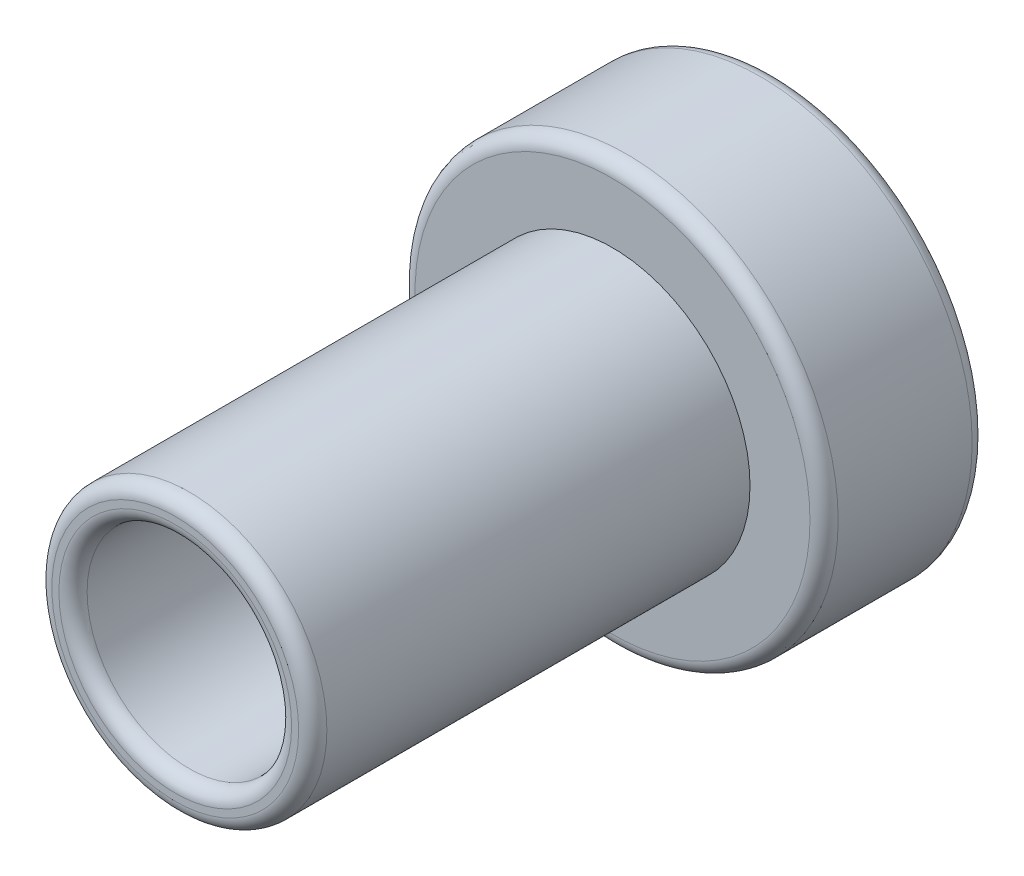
ISO-10303-21;
HEADER;
FILE_DESCRIPTION(('STEP AP214'),'2;1');
FILE_NAME('part.step','',(''),(''),'','','');
FILE_SCHEMA(('AUTOMOTIVE_DESIGN { 1 0 10303 214 1 1 1 1 }'));
ENDSEC;
DATA;
#1=APPLICATION_CONTEXT('core data for automotive mechanical design processes');
#2=APPLICATION_PROTOCOL_DEFINITION('international standard','automotive_design',2000,#1);
#3=PRODUCT_CONTEXT('',#1,'mechanical');
#4=PRODUCT('Part','Part','',(#3));
#5=PRODUCT_RELATED_PRODUCT_CATEGORY('part','',(#4));
#6=PRODUCT_DEFINITION_FORMATION('','',#4);
#7=PRODUCT_DEFINITION_CONTEXT('part definition',#1,'design');
#8=PRODUCT_DEFINITION('design','',#6,#7);
#9=PRODUCT_DEFINITION_SHAPE('','',#8);
#10=(LENGTH_UNIT() NAMED_UNIT(*) SI_UNIT(.MILLI.,.METRE.));
#11=(NAMED_UNIT(*) PLANE_ANGLE_UNIT() SI_UNIT($,.RADIAN.));
#12=(NAMED_UNIT(*) SI_UNIT($,.STERADIAN.) SOLID_ANGLE_UNIT());
#13=UNCERTAINTY_MEASURE_WITH_UNIT(LENGTH_MEASURE(1.E-05),#10,'distance_accuracy_value','');
#14=(GEOMETRIC_REPRESENTATION_CONTEXT(3) GLOBAL_UNCERTAINTY_ASSIGNED_CONTEXT((#13)) GLOBAL_UNIT_ASSIGNED_CONTEXT((#10,
#11,#12)) REPRESENTATION_CONTEXT('',''));
#15=CARTESIAN_POINT('',(0.,0.,0.));
#16=DIRECTION('',(0.,0.,1.));
#17=DIRECTION('',(1.,0.,0.));
#18=AXIS2_PLACEMENT_3D('',#15,#16,#17);
#19=CARTESIAN_POINT('',(0.,0.,2.3));
#20=DIRECTION('',(0.,0.,1.));
#21=DIRECTION('',(1.,0.,0.));
#22=AXIS2_PLACEMENT_3D('',#19,#20,#21);
#23=PLANE('',#22);
#24=CARTESIAN_POINT('',(0.,0.,2.3));
#25=DIRECTION('',(0.,0.,1.));
#26=DIRECTION('',(1.,0.,0.));
#27=AXIS2_PLACEMENT_3D('',#24,#25,#26);
#28=CIRCLE('',#27,2.8);
#29=CARTESIAN_POINT('',(2.8,0.,2.3));
#30=VERTEX_POINT('',#29);
#31=EDGE_CURVE('E31',#30,#30,#28,.T.);
#32=ORIENTED_EDGE('',*,*,#31,.T.);
#33=EDGE_LOOP('',(#32));
#34=FACE_BOUND('',#33,.T.);
#35=CARTESIAN_POINT('',(0.,0.,2.3));
#36=DIRECTION('',(0.,0.,1.));
#37=DIRECTION('',(1.,0.,0.));
#38=AXIS2_PLACEMENT_3D('',#35,#36,#37);
#39=CIRCLE('',#38,1.95);
#40=CARTESIAN_POINT('',(-1.95,0.,2.3));
#41=VERTEX_POINT('',#40);
#42=EDGE_CURVE('E62',#41,#41,#39,.T.);
#43=ORIENTED_EDGE('',*,*,#42,.F.);
#44=EDGE_LOOP('',(#43));
#45=FACE_BOUND('',#44,.T.);
#46=ADVANCED_FACE('F24',(#34,#45),#23,.T.);
#47=CARTESIAN_POINT('',(0.,0.,2.3));
#48=DIRECTION('',(0.,0.,-1.));
#49=DIRECTION('',(-1.,0.,0.));
#50=AXIS2_PLACEMENT_3D('',#47,#48,#49);
#51=CYLINDRICAL_SURFACE('',#50,3.);
#52=CARTESIAN_POINT('',(0.,0.,0.2));
#53=DIRECTION('',(0.,0.,1.));
#54=DIRECTION('',(1.,0.,0.));
#55=AXIS2_PLACEMENT_3D('',#52,#53,#54);
#56=CIRCLE('',#55,3.);
#57=CARTESIAN_POINT('',(3.,0.,0.2));
#58=VERTEX_POINT('',#57);
#59=EDGE_CURVE('E35',#58,#58,#56,.T.);
#60=ORIENTED_EDGE('',*,*,#59,.T.);
#61=EDGE_LOOP('',(#60));
#62=FACE_BOUND('',#61,.T.);
#63=CARTESIAN_POINT('',(0.,0.,2.1));
#64=DIRECTION('',(0.,0.,1.));
#65=DIRECTION('',(1.,0.,0.));
#66=AXIS2_PLACEMENT_3D('',#63,#64,#65);
#67=CIRCLE('',#66,3.);
#68=CARTESIAN_POINT('',(3.,0.,2.1));
#69=VERTEX_POINT('',#68);
#70=EDGE_CURVE('E39',#69,#69,#67,.F.);
#71=ORIENTED_EDGE('',*,*,#70,.T.);
#72=EDGE_LOOP('',(#71));
#73=FACE_BOUND('',#72,.T.);
#74=ADVANCED_FACE('F26',(#62,#73),#51,.T.);
#75=CARTESIAN_POINT('',(0.,0.,0.));
#76=DIRECTION('',(0.,0.,1.));
#77=DIRECTION('',(1.,0.,0.));
#78=AXIS2_PLACEMENT_3D('',#75,#76,#77);
#79=PLANE('',#78);
#80=CARTESIAN_POINT('',(0.,0.,0.));
#81=DIRECTION('',(0.,0.,1.));
#82=DIRECTION('',(1.,0.,0.));
#83=AXIS2_PLACEMENT_3D('',#80,#81,#82);
#84=CIRCLE('',#83,1.65);
#85=CARTESIAN_POINT('',(1.65,0.,0.));
#86=VERTEX_POINT('',#85);
#87=EDGE_CURVE('E56',#86,#86,#84,.T.);
#88=ORIENTED_EDGE('',*,*,#87,.T.);
#89=EDGE_LOOP('',(#88));
#90=FACE_BOUND('',#89,.T.);
#91=CARTESIAN_POINT('',(0.,0.,0.));
#92=DIRECTION('',(0.,0.,1.));
#93=DIRECTION('',(1.,0.,0.));
#94=AXIS2_PLACEMENT_3D('',#91,#92,#93);
#95=CIRCLE('',#94,2.8);
#96=CARTESIAN_POINT('',(2.8,0.,0.));
#97=VERTEX_POINT('',#96);
#98=EDGE_CURVE('E59',#97,#97,#95,.F.);
#99=ORIENTED_EDGE('',*,*,#98,.T.);
#100=EDGE_LOOP('',(#99));
#101=FACE_BOUND('',#100,.T.);
#102=ADVANCED_FACE('F72',(#90,#101),#79,.F.);
#103=CARTESIAN_POINT('',(0.,0.,8.5));
#104=DIRECTION('',(0.,0.,-1.));
#105=DIRECTION('',(-1.,0.,0.));
#106=AXIS2_PLACEMENT_3D('',#103,#104,#105);
#107=CYLINDRICAL_SURFACE('',#106,1.95);
#108=CARTESIAN_POINT('',(0.,0.,8.3));
#109=DIRECTION('',(0.,0.,1.));
#110=DIRECTION('',(1.,0.,0.));
#111=AXIS2_PLACEMENT_3D('',#108,#109,#110);
#112=CIRCLE('',#111,1.95);
#113=CARTESIAN_POINT('',(-1.95,0.,8.3));
#114=VERTEX_POINT('',#113);
#115=EDGE_CURVE('E10',#114,#114,#112,.F.);
#116=CARTESIAN_POINT('',(-1.95,0.,8.3));
#117=CARTESIAN_POINT('',(-1.95,0.,8.2375));
#118=CARTESIAN_POINT('',(-1.95,0.,8.175));
#119=CARTESIAN_POINT('',(-1.95,0.,8.05));
#120=CARTESIAN_POINT('',(-1.95,0.,7.9875));
#121=CARTESIAN_POINT('',(-1.95,0.,7.8625));
#122=CARTESIAN_POINT('',(-1.95,0.,7.8));
#123=CARTESIAN_POINT('',(-1.95,0.,7.675));
#124=CARTESIAN_POINT('',(-1.95,0.,7.6125));
#125=CARTESIAN_POINT('',(-1.95,0.,7.4875));
#126=CARTESIAN_POINT('',(-1.95,0.,7.425));
#127=CARTESIAN_POINT('',(-1.95,0.,7.3));
#128=CARTESIAN_POINT('',(-1.95,0.,7.2375));
#129=CARTESIAN_POINT('',(-1.95,0.,7.1125));
#130=CARTESIAN_POINT('',(-1.95,0.,7.05));
#131=CARTESIAN_POINT('',(-1.95,0.,6.925));
#132=CARTESIAN_POINT('',(-1.95,0.,6.8625));
#133=CARTESIAN_POINT('',(-1.95,0.,6.7375));
#134=CARTESIAN_POINT('',(-1.95,0.,6.675));
#135=CARTESIAN_POINT('',(-1.95,0.,6.55));
#136=CARTESIAN_POINT('',(-1.95,0.,6.4875));
#137=CARTESIAN_POINT('',(-1.95,0.,6.3625));
#138=CARTESIAN_POINT('',(-1.95,0.,6.3));
#139=CARTESIAN_POINT('',(-1.95,0.,6.175));
#140=CARTESIAN_POINT('',(-1.95,0.,6.1125));
#141=CARTESIAN_POINT('',(-1.95,0.,5.9875));
#142=CARTESIAN_POINT('',(-1.95,0.,5.925));
#143=CARTESIAN_POINT('',(-1.95,0.,5.8));
#144=CARTESIAN_POINT('',(-1.95,0.,5.7375));
#145=CARTESIAN_POINT('',(-1.95,0.,5.6125));
#146=CARTESIAN_POINT('',(-1.95,0.,5.55));
#147=CARTESIAN_POINT('',(-1.95,0.,5.425));
#148=CARTESIAN_POINT('',(-1.95,0.,5.3625));
#149=CARTESIAN_POINT('',(-1.95,0.,5.2375));
#150=CARTESIAN_POINT('',(-1.95,0.,5.175));
#151=CARTESIAN_POINT('',(-1.95,0.,5.05));
#152=CARTESIAN_POINT('',(-1.95,0.,4.9875));
#153=CARTESIAN_POINT('',(-1.95,0.,4.8625));
#154=CARTESIAN_POINT('',(-1.95,0.,4.8));
#155=CARTESIAN_POINT('',(-1.95,0.,4.675));
#156=CARTESIAN_POINT('',(-1.95,0.,4.6125));
#157=CARTESIAN_POINT('',(-1.95,0.,4.4875));
#158=CARTESIAN_POINT('',(-1.95,0.,4.425));
#159=CARTESIAN_POINT('',(-1.95,0.,4.3));
#160=CARTESIAN_POINT('',(-1.95,0.,4.2375));
#161=CARTESIAN_POINT('',(-1.95,0.,4.1125));
#162=CARTESIAN_POINT('',(-1.95,0.,4.05));
#163=CARTESIAN_POINT('',(-1.95,0.,3.925));
#164=CARTESIAN_POINT('',(-1.95,0.,3.8625));
#165=CARTESIAN_POINT('',(-1.95,0.,3.7375));
#166=CARTESIAN_POINT('',(-1.95,0.,3.675));
#167=CARTESIAN_POINT('',(-1.95,0.,3.55));
#168=CARTESIAN_POINT('',(-1.95,0.,3.4875));
#169=CARTESIAN_POINT('',(-1.95,0.,3.3625));
#170=CARTESIAN_POINT('',(-1.95,0.,3.3));
#171=CARTESIAN_POINT('',(-1.95,0.,3.175));
#172=CARTESIAN_POINT('',(-1.95,0.,3.1125));
#173=CARTESIAN_POINT('',(-1.95,0.,2.9875));
#174=CARTESIAN_POINT('',(-1.95,0.,2.925));
#175=CARTESIAN_POINT('',(-1.95,0.,2.8));
#176=CARTESIAN_POINT('',(-1.95,0.,2.7375));
#177=CARTESIAN_POINT('',(-1.95,0.,2.6125));
#178=CARTESIAN_POINT('',(-1.95,0.,2.55));
#179=CARTESIAN_POINT('',(-1.95,0.,2.425));
#180=CARTESIAN_POINT('',(-1.95,0.,2.3625));
#181=CARTESIAN_POINT('',(-1.95,0.,2.3));
#182=B_SPLINE_CURVE_WITH_KNOTS('',3,(#116,#117,#118,#119,#120,#121,#122,#123,#124,#125,#126,
#127,#128,#129,#130,#131,#132,#133,#134,#135,#136,#137,#138,#139,#140,#141,#142,#143,#144,#145,
#146,#147,#148,#149,#150,#151,#152,#153,#154,#155,#156,#157,#158,#159,#160,#161,#162,#163,#164,
#165,#166,#167,#168,#169,#170,#171,#172,#173,#174,#175,#176,#177,#178,#179,#180,#181),
.UNSPECIFIED.,.F.,.F.,(4,2,2,2,2,2,2,2,2,2,2,2,2,2,2,2,2,2,2,2,2,2,2,2,2,2,2,2,2,2,2,2,4),(0.,
0.1875,0.375,0.5625,0.750000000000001,0.937500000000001,1.125,1.3125,1.5,1.6875,1.875,2.0625,
2.25,2.4375,2.625,2.8125,3.,3.1875,3.375,3.5625,3.75,3.9375,4.125,4.3125,4.5,4.6875,4.875,
5.0625,5.25,5.4375,5.625,5.8125,6.),.UNSPECIFIED.);
#183=EDGE_CURVE('BSEAM66',#114,#41,#182,.T.);
#184=ORIENTED_EDGE('',*,*,#115,.T.);
#185=ORIENTED_EDGE('',*,*,#42,.T.);
#186=ORIENTED_EDGE('',*,*,#183,.T.);
#187=ORIENTED_EDGE('',*,*,#183,.F.);
#188=EDGE_LOOP('',(#184,#186,#185,#187));
#189=FACE_BOUND('',#188,.T.);
#190=ADVANCED_FACE('F66',(#189),#107,.T.);
#191=CARTESIAN_POINT('',(0.,0.,8.5));
#192=DIRECTION('',(0.,0.,1.));
#193=DIRECTION('',(1.,0.,0.));
#194=AXIS2_PLACEMENT_3D('',#191,#192,#193);
#195=PLANE('',#194);
#196=CARTESIAN_POINT('',(0.,0.,8.5));
#197=DIRECTION('',(0.,0.,1.));
#198=DIRECTION('',(1.,0.,0.));
#199=AXIS2_PLACEMENT_3D('',#196,#197,#198);
#200=CIRCLE('',#199,1.65);
#201=CARTESIAN_POINT('',(1.65,0.,8.5));
#202=VERTEX_POINT('',#201);
#203=EDGE_CURVE('E44',#202,#202,#200,.F.);
#204=ORIENTED_EDGE('',*,*,#203,.T.);
#205=EDGE_LOOP('',(#204));
#206=FACE_BOUND('',#205,.T.);
#207=CARTESIAN_POINT('',(0.,0.,8.5));
#208=DIRECTION('',(0.,0.,1.));
#209=DIRECTION('',(1.,0.,0.));
#210=AXIS2_PLACEMENT_3D('',#207,#208,#209);
#211=CIRCLE('',#210,1.75);
#212=CARTESIAN_POINT('',(1.75,0.,8.5));
#213=VERTEX_POINT('',#212);
#214=EDGE_CURVE('E47',#213,#213,#211,.T.);
#215=ORIENTED_EDGE('',*,*,#214,.T.);
#216=EDGE_LOOP('',(#215));
#217=FACE_BOUND('',#216,.T.);
#218=ADVANCED_FACE('F80',(#206,#217),#195,.T.);
#219=CARTESIAN_POINT('',(0.,0.,0.));
#220=DIRECTION('',(0.,0.,1.));
#221=DIRECTION('',(1.,0.,0.));
#222=AXIS2_PLACEMENT_3D('',#219,#220,#221);
#223=CYLINDRICAL_SURFACE('',#222,1.45);
#224=CARTESIAN_POINT('',(0.,0.,0.2));
#225=DIRECTION('',(0.,0.,1.));
#226=DIRECTION('',(1.,0.,0.));
#227=AXIS2_PLACEMENT_3D('',#224,#225,#226);
#228=CIRCLE('',#227,1.45);
#229=CARTESIAN_POINT('',(1.45,0.,0.2));
#230=VERTEX_POINT('',#229);
#231=EDGE_CURVE('E50',#230,#230,#228,.F.);
#232=ORIENTED_EDGE('',*,*,#231,.T.);
#233=EDGE_LOOP('',(#232));
#234=FACE_BOUND('',#233,.T.);
#235=CARTESIAN_POINT('',(0.,0.,8.3));
#236=DIRECTION('',(0.,0.,1.));
#237=DIRECTION('',(1.,0.,0.));
#238=AXIS2_PLACEMENT_3D('',#235,#236,#237);
#239=CIRCLE('',#238,1.45);
#240=CARTESIAN_POINT('',(1.45,0.,8.3));
#241=VERTEX_POINT('',#240);
#242=EDGE_CURVE('E53',#241,#241,#239,.T.);
#243=ORIENTED_EDGE('',*,*,#242,.T.);
#244=EDGE_LOOP('',(#243));
#245=FACE_BOUND('',#244,.T.);
#246=ADVANCED_FACE('F83',(#234,#245),#223,.F.);
#247=CARTESIAN_POINT('',(0.,0.,0.2));
#248=DIRECTION('',(0.,0.,1.));
#249=DIRECTION('',(1.,0.,0.));
#250=AXIS2_PLACEMENT_3D('',#247,#248,#249);
#251=TOROIDAL_SURFACE('',#250,1.65,0.2);
#252=ORIENTED_EDGE('',*,*,#231,.F.);
#253=EDGE_LOOP('',(#252));
#254=FACE_BOUND('',#253,.T.);
#255=ORIENTED_EDGE('',*,*,#87,.F.);
#256=EDGE_LOOP('',(#255));
#257=FACE_BOUND('',#256,.T.);
#258=ADVANCED_FACE('F87',(#254,#257),#251,.T.);
#259=CARTESIAN_POINT('',(0.,0.,8.3));
#260=DIRECTION('',(0.,0.,1.));
#261=DIRECTION('',(1.,0.,0.));
#262=AXIS2_PLACEMENT_3D('',#259,#260,#261);
#263=TOROIDAL_SURFACE('',#262,1.65,0.2);
#264=ORIENTED_EDGE('',*,*,#203,.F.);
#265=EDGE_LOOP('',(#264));
#266=FACE_BOUND('',#265,.T.);
#267=ORIENTED_EDGE('',*,*,#242,.F.);
#268=EDGE_LOOP('',(#267));
#269=FACE_BOUND('',#268,.T.);
#270=ADVANCED_FACE('F91',(#266,#269),#263,.T.);
#271=CARTESIAN_POINT('',(0.,0.,0.2));
#272=DIRECTION('',(0.,0.,1.));
#273=DIRECTION('',(1.,0.,0.));
#274=AXIS2_PLACEMENT_3D('',#271,#272,#273);
#275=TOROIDAL_SURFACE('',#274,2.8,0.2);
#276=ORIENTED_EDGE('',*,*,#98,.F.);
#277=EDGE_LOOP('',(#276));
#278=FACE_BOUND('',#277,.T.);
#279=ORIENTED_EDGE('',*,*,#59,.F.);
#280=EDGE_LOOP('',(#279));
#281=FACE_BOUND('',#280,.T.);
#282=ADVANCED_FACE('F95',(#278,#281),#275,.T.);
#283=CARTESIAN_POINT('',(0.,0.,2.1));
#284=DIRECTION('',(0.,0.,1.));
#285=DIRECTION('',(1.,0.,0.));
#286=AXIS2_PLACEMENT_3D('',#283,#284,#285);
#287=TOROIDAL_SURFACE('',#286,2.8,0.2);
#288=ORIENTED_EDGE('',*,*,#70,.F.);
#289=EDGE_LOOP('',(#288));
#290=FACE_BOUND('',#289,.T.);
#291=ORIENTED_EDGE('',*,*,#31,.F.);
#292=EDGE_LOOP('',(#291));
#293=FACE_BOUND('',#292,.T.);
#294=ADVANCED_FACE('F99',(#290,#293),#287,.T.);
#295=CARTESIAN_POINT('',(0.,0.,8.3));
#296=DIRECTION('',(0.,0.,1.));
#297=DIRECTION('',(1.,0.,0.));
#298=AXIS2_PLACEMENT_3D('',#295,#296,#297);
#299=TOROIDAL_SURFACE('',#298,1.75,0.2);
#300=ORIENTED_EDGE('',*,*,#115,.F.);
#301=EDGE_LOOP('',(#300));
#302=FACE_BOUND('',#301,.T.);
#303=ORIENTED_EDGE('',*,*,#214,.F.);
#304=EDGE_LOOP('',(#303));
#305=FACE_BOUND('',#304,.T.);
#306=ADVANCED_FACE('F103',(#302,#305),#299,.T.);
#307=CLOSED_SHELL('',(#46,#74,#102,#190,#218,#246,#258,#270,#282,#294,#306));
#308=MANIFOLD_SOLID_BREP('B2',#307);
#309=ADVANCED_BREP_SHAPE_REPRESENTATION('',(#18,#308),#14);
#310=SHAPE_DEFINITION_REPRESENTATION(#9,#309);
ENDSEC;
END-ISO-10303-21;
